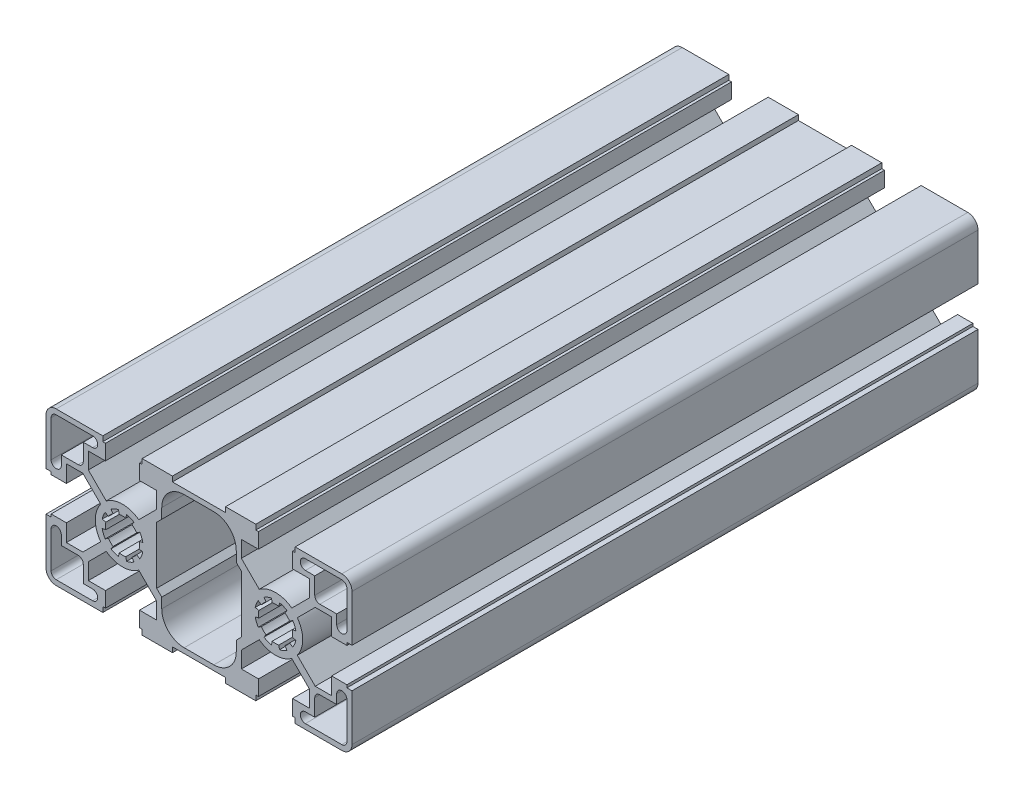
from build123d import *

# Parameters (mm, degrees)
BOSS_EXTRUDE1_DEPTH = 92.075


with BuildPart() as part:
    # Sketch1 → Boss-Extrude1 (new, symmetric)
    with BuildSketch(Plane.XY):
        with BuildLine():
            Line((-42.0116, 22.5044), (-28.2956, 22.5044))
            Line((-28.2956, 22.5044), (-28.2956, 21.0058))
            Line((-28.2956, 21.0058), (-27.5082, 21.0058))
            Line((-27.5082, 21.0058), (-27.5082, 16.51))
            Line((-27.5082, 16.51), (-32.5501, 16.51))
            Line((-32.5501, 16.51), (-32.5501, 11.680106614))
            Line((-32.5501, 11.680106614), (-27.285426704, 6.415433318))
            ThreePointArc((-27.285426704, 6.415433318), (-22.5044, 8.001), (-17.723373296, 6.415433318))
            Line((-17.723373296, 6.415433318), (-12.4587, 11.680106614))
            Line((-12.4587, 11.680106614), (-12.4587, 16.51))
            Line((-12.4587, 16.51), (-17.5006, 16.51))
            Line((-17.5006, 16.51), (-17.5006, 21.0058))
            Line((-17.5006, 21.0058), (-16.7132, 21.0058))
            Line((-16.7132, 21.0058), (-16.7132, 22.5044))
            Line((-16.7132, 22.5044), (-7.8105, 22.5044))
            Line((-7.8105, 22.5044), (-7.8105, 21.0058))
            Line((-7.8105, 21.0058), (7.8105, 21.0058))
            Line((7.8105, 21.0058), (7.8105, 22.5044))
            Line((7.8105, 22.5044), (16.7132, 22.5044))
            Line((16.7132, 22.5044), (16.7132, 21.0058))
            Line((16.7132, 21.0058), (17.5006, 21.0058))
            Line((17.5006, 21.0058), (17.5006, 16.51))
            Line((17.5006, 16.51), (12.4587, 16.51))
            Line((12.4587, 16.51), (12.4587, 11.680106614))
            Line((12.4587, 11.680106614), (17.723373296, 6.415433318))
            ThreePointArc((17.723373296, 6.415433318), (22.5044, 8.001), (27.285426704, 6.415433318))
            Line((27.285426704, 6.415433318), (32.5501, 11.680106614))
            Line((32.5501, 11.680106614), (32.5501, 16.51))
            Line((32.5501, 16.51), (27.5082, 16.51))
            Line((27.5082, 16.51), (27.5082, 21.0058))
            Line((27.5082, 21.0058), (28.2956, 21.0058))
            Line((28.2956, 21.0058), (28.2956, 22.5044))
            Line((28.2956, 22.5044), (42.0116, 22.5044))
            ThreePointArc((42.0116, 22.5044), (44.130940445, 21.626540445), (45.0088, 19.5072))
            Line((45.0088, 19.5072), (45.0088, 5.7912))
            Line((45.0088, 5.7912), (43.5102, 5.7912))
            Line((43.5102, 5.7912), (43.5102, 5.0038))
            Line((43.5102, 5.0038), (39.0144, 5.0038))
            Line((39.0144, 5.0038), (39.0144, 10.0457))
            Line((39.0144, 10.0457), (34.184506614, 10.0457))
            Line((34.184506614, 10.0457), (28.919833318, 4.781026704))
            ThreePointArc((28.919833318, 4.781026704), (30.5054, 0), (28.919833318, -4.781026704))
            Line((28.919833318, -4.781026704), (34.184506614, -10.0457))
            Line((34.184506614, -10.0457), (39.0144, -10.0457))
            Line((39.0144, -10.0457), (39.0144, -5.0038))
            Line((39.0144, -5.0038), (43.5102, -5.0038))
            Line((43.5102, -5.0038), (43.5102, -5.7912))
            Line((43.5102, -5.7912), (45.0088, -5.7912))
            Line((45.0088, -5.7912), (45.0088, -19.5072))
            ThreePointArc((45.0088, -19.5072), (44.130940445, -21.626540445), (42.0116, -22.5044))
            Line((42.0116, -22.5044), (28.2956, -22.5044))
            Line((28.2956, -22.5044), (28.2956, -21.0058))
            Line((28.2956, -21.0058), (27.5082, -21.0058))
            Line((27.5082, -21.0058), (27.5082, -16.51))
            Line((27.5082, -16.51), (32.5501, -16.51))
            Line((32.5501, -16.51), (32.5501, -11.680106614))
            Line((32.5501, -11.680106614), (27.285426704, -6.415433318))
            ThreePointArc((27.285426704, -6.415433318), (22.5044, -8.001), (17.723373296, -6.415433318))
            Line((17.723373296, -6.415433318), (12.4587, -11.680106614))
            Line((12.4587, -11.680106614), (12.4587, -16.51))
            Line((12.4587, -16.51), (17.5006, -16.51))
            Line((17.5006, -16.51), (17.5006, -21.0058))
            Line((17.5006, -21.0058), (16.7132, -21.0058))
            Line((16.7132, -21.0058), (16.7132, -22.5044))
            Line((16.7132, -22.5044), (7.8105, -22.5044))
            Line((7.8105, -22.5044), (7.8105, -21.0058))
            Line((7.8105, -21.0058), (-7.8105, -21.0058))
            Line((-7.8105, -21.0058), (-7.8105, -22.5044))
            Line((-7.8105, -22.5044), (-16.7132, -22.5044))
            Line((-16.7132, -22.5044), (-16.7132, -21.0058))
            Line((-16.7132, -21.0058), (-17.5006, -21.0058))
            Line((-17.5006, -21.0058), (-17.5006, -16.51))
            Line((-17.5006, -16.51), (-12.4587, -16.51))
            Line((-12.4587, -16.51), (-12.4587, -11.680106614))
            Line((-12.4587, -11.680106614), (-17.723373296, -6.415433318))
            ThreePointArc((-17.723373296, -6.415433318), (-22.5044, -8.001), (-27.285426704, -6.415433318))
            Line((-27.285426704, -6.415433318), (-32.5501, -11.680106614))
            Line((-32.5501, -11.680106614), (-32.5501, -16.51))
            Line((-32.5501, -16.51), (-27.5082, -16.51))
            Line((-27.5082, -16.51), (-27.5082, -21.0058))
            Line((-27.5082, -21.0058), (-28.2956, -21.0058))
            Line((-28.2956, -21.0058), (-28.2956, -22.5044))
            Line((-28.2956, -22.5044), (-42.0116, -22.5044))
            ThreePointArc((-42.0116, -22.5044), (-44.130940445, -21.626540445), (-45.0088, -19.5072))
            Line((-45.0088, -19.5072), (-45.0088, -5.7912))
            Line((-45.0088, -5.7912), (-43.5102, -5.7912))
            Line((-43.5102, -5.7912), (-43.5102, -5.0038))
            Line((-43.5102, -5.0038), (-39.0144, -5.0038))
            Line((-39.0144, -5.0038), (-39.0144, -10.0457))
            Line((-39.0144, -10.0457), (-34.184506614, -10.0457))
            Line((-34.184506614, -10.0457), (-28.919833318, -4.781026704))
            ThreePointArc((-28.919833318, -4.781026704), (-30.5054, 0), (-28.919833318, 4.781026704))
            Line((-28.919833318, 4.781026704), (-34.184506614, 10.0457))
            Line((-34.184506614, 10.0457), (-39.0144, 10.0457))
            Line((-39.0144, 10.0457), (-39.0144, 5.0038))
            Line((-39.0144, 5.0038), (-43.5102, 5.0038))
            Line((-43.5102, 5.0038), (-43.5102, 5.7912))
            Line((-43.5102, 5.7912), (-45.0088, 5.7912))
            Line((-45.0088, 5.7912), (-45.0088, 19.5072))
            ThreePointArc((-45.0088, 19.5072), (-44.130940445, 21.626540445), (-42.0116, 22.5044))
        make_face()
        with BuildLine():
            Line((-40.513, 11.5443), (-35.5473, 11.5443))
            ThreePointArc((-35.5473, 11.5443), (-34.487629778, 11.983229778), (-34.0487, 13.0429))
            Line((-34.0487, 13.0429), (-34.0487, 18.0086))
            Line((-34.0487, 18.0086), (-31.2928, 18.0086))
            ThreePointArc((-31.2928, 18.0086), (-29.7942, 19.5072), (-31.2928, 21.0058))
            Line((-31.2928, 21.0058), (-42.0116, 21.0058))
            ThreePointArc((-42.0116, 21.0058), (-43.071270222, 20.566870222), (-43.5102, 19.5072))
            Line((-43.5102, 19.5072), (-43.5102, 8.7884))
            ThreePointArc((-43.5102, 8.7884), (-42.0116, 7.2898), (-40.513, 8.7884))
            Line((-40.513, 8.7884), (-40.513, 11.5443))
        make_face(mode=Mode.SUBTRACT)
        with BuildLine():
            Line((-21.315129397, 5.978867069), (-21.528207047, 4.907653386))
            ThreePointArc((-21.528207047, 4.907653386), (-22.5044, 5.0038), (-23.480592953, 4.907653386))
            Line((-23.480592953, 4.907653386), (-23.693670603, 5.978867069))
            ThreePointArc((-23.693670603, 5.978867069), (-24.837238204, 5.63196963), (-25.89115614, 5.068638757))
            Line((-25.89115614, 5.068638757), (-25.284362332, 4.160507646))
            ThreePointArc((-25.284362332, 4.160507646), (-26.042620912, 3.538220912), (-26.664907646, 2.779962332))
            Line((-26.664907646, 2.779962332), (-27.573038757, 3.38675614))
            ThreePointArc((-27.573038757, 3.38675614), (-28.13636963, 2.332838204), (-28.483267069, 1.189270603))
            Line((-28.483267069, 1.189270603), (-27.412053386, 0.976192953))
            ThreePointArc((-27.412053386, 0.976192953), (-27.5082, 0), (-27.412053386, -0.976192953))
            Line((-27.412053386, -0.976192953), (-28.483267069, -1.189270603))
            ThreePointArc((-28.483267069, -1.189270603), (-28.13636963, -2.332838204), (-27.573038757, -3.38675614))
            Line((-27.573038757, -3.38675614), (-26.664907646, -2.779962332))
            ThreePointArc((-26.664907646, -2.779962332), (-26.042620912, -3.538220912), (-25.284362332, -4.160507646))
            Line((-25.284362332, -4.160507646), (-25.89115614, -5.068638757))
            ThreePointArc((-25.89115614, -5.068638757), (-24.837238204, -5.63196963), (-23.693670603, -5.978867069))
            Line((-23.693670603, -5.978867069), (-23.480592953, -4.907653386))
            ThreePointArc((-23.480592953, -4.907653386), (-22.5044, -5.0038), (-21.528207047, -4.907653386))
            Line((-21.528207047, -4.907653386), (-21.315129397, -5.978867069))
            ThreePointArc((-21.315129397, -5.978867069), (-20.171561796, -5.63196963), (-19.11764386, -5.068638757))
            Line((-19.11764386, -5.068638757), (-19.724437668, -4.160507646))
            ThreePointArc((-19.724437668, -4.160507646), (-18.966179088, -3.538220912), (-18.343892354, -2.779962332))
            Line((-18.343892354, -2.779962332), (-17.435761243, -3.38675614))
            ThreePointArc((-17.435761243, -3.38675614), (-16.87243037, -2.332838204), (-16.525532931, -1.189270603))
            Line((-16.525532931, -1.189270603), (-17.596746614, -0.976192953))
            ThreePointArc((-17.596746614, -0.976192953), (-17.5006, 0), (-17.596746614, 0.976192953))
            Line((-17.596746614, 0.976192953), (-16.525532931, 1.189270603))
            ThreePointArc((-16.525532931, 1.189270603), (-16.87243037, 2.332838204), (-17.435761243, 3.38675614))
            Line((-17.435761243, 3.38675614), (-18.343892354, 2.779962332))
            ThreePointArc((-18.343892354, 2.779962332), (-18.966179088, 3.538220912), (-19.724437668, 4.160507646))
            Line((-19.724437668, 4.160507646), (-19.11764386, 5.068638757))
            ThreePointArc((-19.11764386, 5.068638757), (-20.171561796, 5.63196963), (-21.315129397, 5.978867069))
        make_face(mode=Mode.SUBTRACT)
        with BuildLine():
            Line((-10.9601, 9.909893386), (-12.4587, 8.411293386))
            Line((-12.4587, 8.411293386), (-12.4587, -8.411293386))
            Line((-12.4587, -8.411293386), (-10.9601, -9.909893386))
            Line((-10.9601, -9.909893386), (-10.9601, -12.9032))
            ThreePointArc((-10.9601, -12.9032), (-9.025833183, -17.572933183), (-4.3561, -19.5072))
            Line((-4.3561, -19.5072), (4.3561, -19.5072))
            ThreePointArc((4.3561, -19.5072), (9.025833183, -17.572933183), (10.9601, -12.9032))
            Line((10.9601, -12.9032), (10.9601, -9.909893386))
            Line((10.9601, -9.909893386), (12.4587, -8.411293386))
            Line((12.4587, -8.411293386), (12.4587, 8.411293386))
            Line((12.4587, 8.411293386), (10.9601, 9.909893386))
            Line((10.9601, 9.909893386), (10.9601, 12.9032))
            ThreePointArc((10.9601, 12.9032), (9.025833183, 17.572933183), (4.3561, 19.5072))
            Line((4.3561, 19.5072), (-4.3561, 19.5072))
            ThreePointArc((-4.3561, 19.5072), (-9.025833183, 17.572933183), (-10.9601, 12.9032))
            Line((-10.9601, 12.9032), (-10.9601, 9.909893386))
        make_face(mode=Mode.SUBTRACT)
        with BuildLine():
            Line((-40.513, -11.5443), (-35.5473, -11.5443))
            ThreePointArc((-35.5473, -11.5443), (-34.487629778, -11.983229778), (-34.0487, -13.0429))
            Line((-34.0487, -13.0429), (-34.0487, -18.0086))
            Line((-34.0487, -18.0086), (-31.2928, -18.0086))
            ThreePointArc((-31.2928, -18.0086), (-29.7942, -19.5072), (-31.2928, -21.0058))
            Line((-31.2928, -21.0058), (-42.0116, -21.0058))
            ThreePointArc((-42.0116, -21.0058), (-43.071270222, -20.566870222), (-43.5102, -19.5072))
            Line((-43.5102, -19.5072), (-43.5102, -8.7884))
            ThreePointArc((-43.5102, -8.7884), (-42.0116, -7.2898), (-40.513, -8.7884))
            Line((-40.513, -8.7884), (-40.513, -11.5443))
        make_face(mode=Mode.SUBTRACT)
        with BuildLine():
            Line((42.0116, 21.0058), (31.2928, 21.0058))
            ThreePointArc((31.2928, 21.0058), (29.7942, 19.5072), (31.2928, 18.0086))
            Line((31.2928, 18.0086), (34.0487, 18.0086))
            Line((34.0487, 18.0086), (34.0487, 13.0429))
            ThreePointArc((34.0487, 13.0429), (34.487629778, 11.983229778), (35.5473, 11.5443))
            Line((35.5473, 11.5443), (40.513, 11.5443))
            Line((40.513, 11.5443), (40.513, 8.7884))
            ThreePointArc((40.513, 8.7884), (42.0116, 7.2898), (43.5102, 8.7884))
            Line((43.5102, 8.7884), (43.5102, 19.5072))
            ThreePointArc((43.5102, 19.5072), (43.071270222, 20.566870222), (42.0116, 21.0058))
        make_face(mode=Mode.SUBTRACT)
        with BuildLine():
            Line((40.513, -11.5443), (35.5473, -11.5443))
            ThreePointArc((35.5473, -11.5443), (34.487629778, -11.983229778), (34.0487, -13.0429))
            Line((34.0487, -13.0429), (34.0487, -18.0086))
            Line((34.0487, -18.0086), (31.2928, -18.0086))
            ThreePointArc((31.2928, -18.0086), (29.7942, -19.5072), (31.2928, -21.0058))
            Line((31.2928, -21.0058), (42.0116, -21.0058))
            ThreePointArc((42.0116, -21.0058), (43.071270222, -20.566870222), (43.5102, -19.5072))
            Line((43.5102, -19.5072), (43.5102, -8.7884))
            ThreePointArc((43.5102, -8.7884), (42.0116, -7.2898), (40.513, -8.7884))
            Line((40.513, -8.7884), (40.513, -11.5443))
        make_face(mode=Mode.SUBTRACT)
        with BuildLine():
            Line((27.573038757, 3.38675614), (26.664907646, 2.779962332))
            ThreePointArc((26.664907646, 2.779962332), (26.042620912, 3.538220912), (25.284362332, 4.160507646))
            Line((25.284362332, 4.160507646), (25.89115614, 5.068638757))
            ThreePointArc((25.89115614, 5.068638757), (24.837238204, 5.63196963), (23.693670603, 5.978867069))
            Line((23.693670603, 5.978867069), (23.480592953, 4.907653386))
            ThreePointArc((23.480592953, 4.907653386), (22.5044, 5.0038), (21.528207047, 4.907653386))
            Line((21.528207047, 4.907653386), (21.315129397, 5.978867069))
            ThreePointArc((21.315129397, 5.978867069), (20.171561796, 5.63196963), (19.11764386, 5.068638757))
            Line((19.11764386, 5.068638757), (19.724437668, 4.160507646))
            ThreePointArc((19.724437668, 4.160507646), (18.966179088, 3.538220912), (18.343892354, 2.779962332))
            Line((18.343892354, 2.779962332), (17.435761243, 3.38675614))
            ThreePointArc((17.435761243, 3.38675614), (16.87243037, 2.332838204), (16.525532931, 1.189270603))
            Line((16.525532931, 1.189270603), (17.596746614, 0.976192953))
            ThreePointArc((17.596746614, 0.976192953), (17.5006, 0), (17.596746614, -0.976192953))
            Line((17.596746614, -0.976192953), (16.525532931, -1.189270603))
            ThreePointArc((16.525532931, -1.189270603), (16.87243037, -2.332838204), (17.435761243, -3.38675614))
            Line((17.435761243, -3.38675614), (18.343892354, -2.779962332))
            ThreePointArc((18.343892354, -2.779962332), (18.966179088, -3.538220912), (19.724437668, -4.160507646))
            Line((19.724437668, -4.160507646), (19.11764386, -5.068638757))
            ThreePointArc((19.11764386, -5.068638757), (20.171561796, -5.63196963), (21.315129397, -5.978867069))
            Line((21.315129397, -5.978867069), (21.528207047, -4.907653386))
            ThreePointArc((21.528207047, -4.907653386), (22.5044, -5.0038), (23.480592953, -4.907653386))
            Line((23.480592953, -4.907653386), (23.693670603, -5.978867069))
            ThreePointArc((23.693670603, -5.978867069), (24.837238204, -5.63196963), (25.89115614, -5.068638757))
            Line((25.89115614, -5.068638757), (25.284362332, -4.160507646))
            ThreePointArc((25.284362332, -4.160507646), (26.042620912, -3.538220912), (26.664907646, -2.779962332))
            Line((26.664907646, -2.779962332), (27.573038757, -3.38675614))
            ThreePointArc((27.573038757, -3.38675614), (28.13636963, -2.332838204), (28.483267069, -1.189270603))
            Line((28.483267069, -1.189270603), (27.412053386, -0.976192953))
            ThreePointArc((27.412053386, -0.976192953), (27.5082, 0), (27.412053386, 0.976192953))
            Line((27.412053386, 0.976192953), (28.483267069, 1.189270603))
            ThreePointArc((28.483267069, 1.189270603), (28.13636963, 2.332838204), (27.573038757, 3.38675614))
        make_face(mode=Mode.SUBTRACT)
    extrude(amount=BOSS_EXTRUDE1_DEPTH, both=True)


solid = part.part
